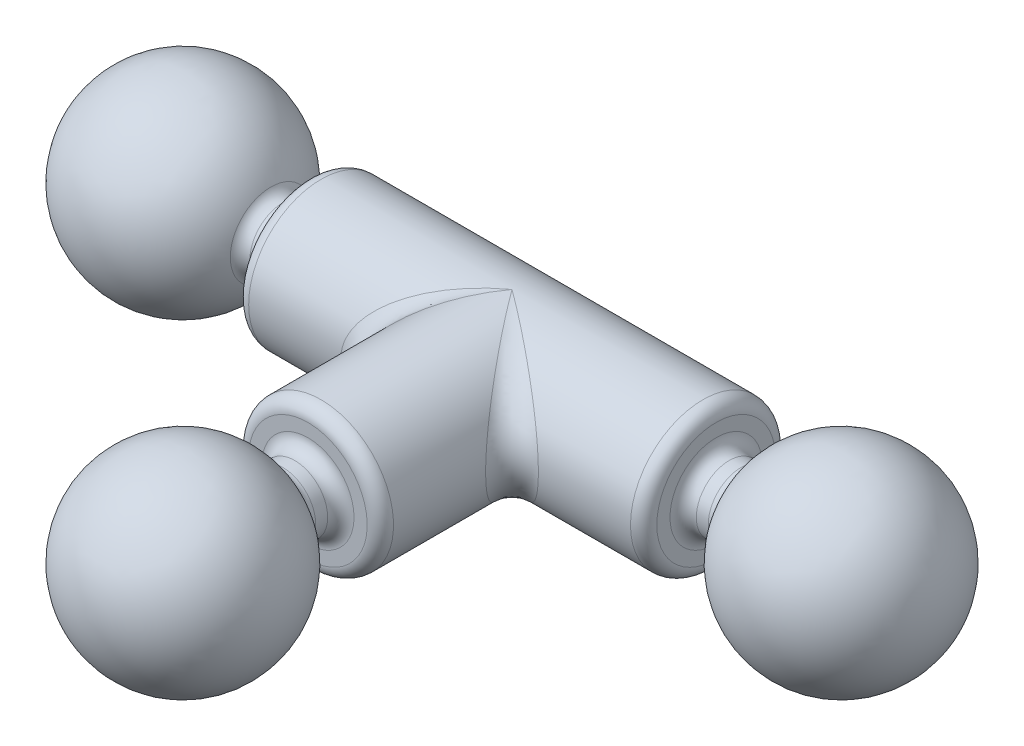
ISO-10303-21;
HEADER;
FILE_DESCRIPTION(('STEP AP214'),'2;1');
FILE_NAME('part.step','',(''),(''),'','','');
FILE_SCHEMA(('AUTOMOTIVE_DESIGN { 1 0 10303 214 1 1 1 1 }'));
ENDSEC;
DATA;
#1=APPLICATION_CONTEXT('core data for automotive mechanical design processes');
#2=APPLICATION_PROTOCOL_DEFINITION('international standard','automotive_design',2000,#1);
#3=PRODUCT_CONTEXT('',#1,'mechanical');
#4=PRODUCT('Part','Part','',(#3));
#5=PRODUCT_RELATED_PRODUCT_CATEGORY('part','',(#4));
#6=PRODUCT_DEFINITION_FORMATION('','',#4);
#7=PRODUCT_DEFINITION_CONTEXT('part definition',#1,'design');
#8=PRODUCT_DEFINITION('design','',#6,#7);
#9=PRODUCT_DEFINITION_SHAPE('','',#8);
#10=(LENGTH_UNIT() NAMED_UNIT(*) SI_UNIT(.MILLI.,.METRE.));
#11=(NAMED_UNIT(*) PLANE_ANGLE_UNIT() SI_UNIT($,.RADIAN.));
#12=(NAMED_UNIT(*) SI_UNIT($,.STERADIAN.) SOLID_ANGLE_UNIT());
#13=UNCERTAINTY_MEASURE_WITH_UNIT(LENGTH_MEASURE(1.E-05),#10,'distance_accuracy_value','');
#14=(GEOMETRIC_REPRESENTATION_CONTEXT(3) GLOBAL_UNCERTAINTY_ASSIGNED_CONTEXT((#13)) GLOBAL_UNIT_ASSIGNED_CONTEXT((#10,
#11,#12)) REPRESENTATION_CONTEXT('',''));
#15=CARTESIAN_POINT('',(0.,0.,0.));
#16=DIRECTION('',(0.,0.,1.));
#17=DIRECTION('',(1.,0.,0.));
#18=AXIS2_PLACEMENT_3D('',#15,#16,#17);
#19=CARTESIAN_POINT('',(-26.105626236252,0.,0.));
#20=DIRECTION('',(-1.,0.,0.));
#21=DIRECTION('',(0.,0.,1.));
#22=AXIS2_PLACEMENT_3D('',#19,#20,#21);
#23=CYLINDRICAL_SURFACE('',#22,6.985);
#24=CARTESIAN_POINT('',(50.165,0.,0.));
#25=DIRECTION('',(-1.,0.,0.));
#26=DIRECTION('',(0.,0.,1.));
#27=AXIS2_PLACEMENT_3D('',#24,#25,#26);
#28=CIRCLE('',#27,6.985);
#29=CARTESIAN_POINT('',(50.165,0.,6.985));
#30=VERTEX_POINT('',#29);
#31=EDGE_CURVE('E163',#30,#30,#28,.T.);
#32=ORIENTED_EDGE('',*,*,#31,.T.);
#33=EDGE_LOOP('',(#32));
#34=FACE_BOUND('',#33,.T.);
#35=CARTESIAN_POINT('',(13.335,0.,0.));
#36=DIRECTION('',(-1.,0.,0.));
#37=DIRECTION('',(0.,0.,1.));
#38=AXIS2_PLACEMENT_3D('',#35,#36,#37);
#39=CIRCLE('',#38,6.985);
#40=CARTESIAN_POINT('',(13.335,0.,6.985));
#41=VERTEX_POINT('',#40);
#42=EDGE_CURVE('E166',#41,#41,#39,.T.);
#43=ORIENTED_EDGE('',*,*,#42,.F.);
#44=EDGE_LOOP('',(#43));
#45=FACE_BOUND('',#44,.T.);
#46=CARTESIAN_POINT('',(31.75,0.,0.));
#47=DIRECTION('',(-0.591363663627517,0.,0.806404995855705));
#48=DIRECTION('',(-0.806404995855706,0.,-0.591363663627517));
#49=AXIS2_PLACEMENT_3D('',#46,#47,#48);
#50=ELLIPSE('',#49,11.8116827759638,6.985);
#51=CARTESIAN_POINT('',(31.75,6.985,0.));
#52=VERTEX_POINT('',#51);
#53=CARTESIAN_POINT('',(31.75,-6.985,0.));
#54=VERTEX_POINT('',#53);
#55=EDGE_CURVE('E45',#52,#54,#50,.F.);
#56=ORIENTED_EDGE('',*,*,#55,.T.);
#57=CARTESIAN_POINT('',(31.75,0.,0.));
#58=DIRECTION('',(0.591363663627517,0.,0.806404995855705));
#59=DIRECTION('',(0.806404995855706,0.,-0.591363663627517));
#60=AXIS2_PLACEMENT_3D('',#57,#58,#59);
#61=ELLIPSE('',#60,11.8116827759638,6.985);
#62=EDGE_CURVE('E11',#54,#52,#61,.F.);
#63=ORIENTED_EDGE('',*,*,#62,.T.);
#64=EDGE_LOOP('',(#56,#63));
#65=FACE_BOUND('',#64,.T.);
#66=ADVANCED_FACE('F32',(#34,#45,#65),#23,.T.);
#67=CARTESIAN_POINT('',(13.335,0.,0.));
#68=DIRECTION('',(-1.,0.,0.));
#69=DIRECTION('',(0.,0.,1.));
#70=AXIS2_PLACEMENT_3D('',#67,#68,#69);
#71=TOROIDAL_SURFACE('',#70,5.715,1.27);
#72=CARTESIAN_POINT('',(12.065,0.,0.));
#73=DIRECTION('',(-1.,0.,0.));
#74=DIRECTION('',(0.,0.,1.));
#75=AXIS2_PLACEMENT_3D('',#72,#73,#74);
#76=CIRCLE('',#75,5.715);
#77=CARTESIAN_POINT('',(12.065,0.,5.715));
#78=VERTEX_POINT('',#77);
#79=EDGE_CURVE('E63',#78,#78,#76,.T.);
#80=ORIENTED_EDGE('',*,*,#79,.F.);
#81=EDGE_LOOP('',(#80));
#82=FACE_BOUND('',#81,.T.);
#83=ORIENTED_EDGE('',*,*,#42,.T.);
#84=EDGE_LOOP('',(#83));
#85=FACE_BOUND('',#84,.T.);
#86=ADVANCED_FACE('F74',(#82,#85),#71,.T.);
#87=CARTESIAN_POINT('',(12.065,5.715,0.));
#88=DIRECTION('',(1.,0.,0.));
#89=DIRECTION('',(0.,0.,-1.));
#90=AXIS2_PLACEMENT_3D('',#87,#88,#89);
#91=PLANE('',#90);
#92=CARTESIAN_POINT('',(12.065,0.,0.));
#93=DIRECTION('',(-1.,0.,0.));
#94=DIRECTION('',(0.,0.,1.));
#95=AXIS2_PLACEMENT_3D('',#92,#93,#94);
#96=CIRCLE('',#95,4.445);
#97=CARTESIAN_POINT('',(12.065,0.,4.445));
#98=VERTEX_POINT('',#97);
#99=EDGE_CURVE('E134',#98,#98,#96,.T.);
#100=ORIENTED_EDGE('',*,*,#99,.F.);
#101=EDGE_LOOP('',(#100));
#102=FACE_BOUND('',#101,.T.);
#103=ORIENTED_EDGE('',*,*,#79,.T.);
#104=EDGE_LOOP('',(#103));
#105=FACE_BOUND('',#104,.T.);
#106=ADVANCED_FACE('F123',(#102,#105),#91,.F.);
#107=CARTESIAN_POINT('',(10.795,0.,0.));
#108=DIRECTION('',(-1.,0.,0.));
#109=DIRECTION('',(0.,0.,1.));
#110=AXIS2_PLACEMENT_3D('',#107,#108,#109);
#111=TOROIDAL_SURFACE('',#110,4.445,1.27);
#112=CARTESIAN_POINT('',(10.795,0.,0.));
#113=DIRECTION('',(-1.,0.,0.));
#114=DIRECTION('',(0.,0.,1.));
#115=AXIS2_PLACEMENT_3D('',#112,#113,#114);
#116=CIRCLE('',#115,3.175);
#117=CARTESIAN_POINT('',(10.795,0.,3.175));
#118=VERTEX_POINT('',#117);
#119=EDGE_CURVE('E137',#118,#118,#116,.T.);
#120=ORIENTED_EDGE('',*,*,#119,.F.);
#121=EDGE_LOOP('',(#120));
#122=FACE_BOUND('',#121,.T.);
#123=ORIENTED_EDGE('',*,*,#99,.T.);
#124=EDGE_LOOP('',(#123));
#125=FACE_BOUND('',#124,.T.);
#126=ADVANCED_FACE('F120',(#122,#125),#111,.F.);
#127=CARTESIAN_POINT('',(-26.105626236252,0.,0.));
#128=DIRECTION('',(-1.,0.,0.));
#129=DIRECTION('',(0.,0.,1.));
#130=AXIS2_PLACEMENT_3D('',#127,#128,#129);
#131=CYLINDRICAL_SURFACE('',#130,3.175);
#132=CARTESIAN_POINT('',(9.64193501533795,0.,0.));
#133=DIRECTION('',(-1.,0.,0.));
#134=DIRECTION('',(0.,0.,1.));
#135=AXIS2_PLACEMENT_3D('',#132,#133,#134);
#136=CIRCLE('',#135,3.175);
#137=CARTESIAN_POINT('',(9.64193501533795,0.,3.175));
#138=VERTEX_POINT('',#137);
#139=EDGE_CURVE('E142',#138,#138,#136,.T.);
#140=ORIENTED_EDGE('',*,*,#139,.F.);
#141=EDGE_LOOP('',(#140));
#142=FACE_BOUND('',#141,.T.);
#143=ORIENTED_EDGE('',*,*,#119,.T.);
#144=EDGE_LOOP('',(#143));
#145=FACE_BOUND('',#144,.T.);
#146=ADVANCED_FACE('F116',(#142,#145),#131,.T.);
#147=CARTESIAN_POINT('',(9.64193501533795,0.,0.));
#148=DIRECTION('',(-1.,0.,0.));
#149=DIRECTION('',(0.,0.,1.));
#150=AXIS2_PLACEMENT_3D('',#147,#148,#149);
#151=TOROIDAL_SURFACE('',#150,4.445,1.27);
#152=CARTESIAN_POINT('',(8.48859350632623,0.,0.));
#153=DIRECTION('',(-1.,0.,0.));
#154=DIRECTION('',(0.,0.,1.));
#155=AXIS2_PLACEMENT_3D('',#152,#153,#154);
#156=CIRCLE('',#155,3.9133014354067);
#157=CARTESIAN_POINT('',(8.48859350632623,0.,3.9133014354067));
#158=VERTEX_POINT('',#157);
#159=EDGE_CURVE('E145',#158,#158,#156,.T.);
#160=ORIENTED_EDGE('',*,*,#159,.F.);
#161=EDGE_LOOP('',(#160));
#162=FACE_BOUND('',#161,.T.);
#163=ORIENTED_EDGE('',*,*,#139,.T.);
#164=EDGE_LOOP('',(#163));
#165=FACE_BOUND('',#164,.T.);
#166=ADVANCED_FACE('F112',(#162,#165),#151,.F.);
#167=CARTESIAN_POINT('',(0.,0.,0.));
#168=DIRECTION('',(-1.,0.,0.));
#169=DIRECTION('',(0.,1.,0.));
#170=AXIS2_PLACEMENT_3D('',#167,#168,#169);
#171=SPHERICAL_SURFACE('',#170,9.3472);
#172=ORIENTED_EDGE('',*,*,#159,.T.);
#173=EDGE_LOOP('',(#172));
#174=FACE_BOUND('',#173,.T.);
#175=ADVANCED_FACE('F108',(#174),#171,.T.);
#176=CARTESIAN_POINT('',(63.5,0.,0.));
#177=DIRECTION('',(-1.,0.,0.));
#178=DIRECTION('',(0.,1.,0.));
#179=AXIS2_PLACEMENT_3D('',#176,#177,#178);
#180=SPHERICAL_SURFACE('',#179,9.3472);
#181=CARTESIAN_POINT('',(55.0114064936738,0.,0.));
#182=DIRECTION('',(-1.,0.,0.));
#183=DIRECTION('',(0.,0.,1.));
#184=AXIS2_PLACEMENT_3D('',#181,#182,#183);
#185=CIRCLE('',#184,3.9133014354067);
#186=CARTESIAN_POINT('',(55.0114064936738,0.,3.9133014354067));
#187=VERTEX_POINT('',#186);
#188=EDGE_CURVE('E148',#187,#187,#185,.T.);
#189=ORIENTED_EDGE('',*,*,#188,.F.);
#190=EDGE_LOOP('',(#189));
#191=FACE_BOUND('',#190,.T.);
#192=ADVANCED_FACE('F104',(#191),#180,.T.);
#193=CARTESIAN_POINT('',(53.8580649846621,0.,0.));
#194=DIRECTION('',(-1.,0.,0.));
#195=DIRECTION('',(0.,0.,1.));
#196=AXIS2_PLACEMENT_3D('',#193,#194,#195);
#197=TOROIDAL_SURFACE('',#196,4.445,1.27);
#198=CARTESIAN_POINT('',(53.8580649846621,0.,0.));
#199=DIRECTION('',(-1.,0.,0.));
#200=DIRECTION('',(0.,0.,1.));
#201=AXIS2_PLACEMENT_3D('',#198,#199,#200);
#202=CIRCLE('',#201,3.175);
#203=CARTESIAN_POINT('',(53.8580649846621,0.,3.175));
#204=VERTEX_POINT('',#203);
#205=EDGE_CURVE('E151',#204,#204,#202,.T.);
#206=ORIENTED_EDGE('',*,*,#205,.F.);
#207=EDGE_LOOP('',(#206));
#208=FACE_BOUND('',#207,.T.);
#209=ORIENTED_EDGE('',*,*,#188,.T.);
#210=EDGE_LOOP('',(#209));
#211=FACE_BOUND('',#210,.T.);
#212=ADVANCED_FACE('F100',(#208,#211),#197,.F.);
#213=CARTESIAN_POINT('',(-26.105626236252,0.,0.));
#214=DIRECTION('',(-1.,0.,0.));
#215=DIRECTION('',(0.,0.,1.));
#216=AXIS2_PLACEMENT_3D('',#213,#214,#215);
#217=CYLINDRICAL_SURFACE('',#216,3.175);
#218=CARTESIAN_POINT('',(52.705,0.,0.));
#219=DIRECTION('',(-1.,0.,0.));
#220=DIRECTION('',(0.,0.,1.));
#221=AXIS2_PLACEMENT_3D('',#218,#219,#220);
#222=CIRCLE('',#221,3.175);
#223=CARTESIAN_POINT('',(52.705,0.,3.175));
#224=VERTEX_POINT('',#223);
#225=EDGE_CURVE('E154',#224,#224,#222,.T.);
#226=ORIENTED_EDGE('',*,*,#225,.F.);
#227=EDGE_LOOP('',(#226));
#228=FACE_BOUND('',#227,.T.);
#229=ORIENTED_EDGE('',*,*,#205,.T.);
#230=EDGE_LOOP('',(#229));
#231=FACE_BOUND('',#230,.T.);
#232=ADVANCED_FACE('F96',(#228,#231),#217,.T.);
#233=CARTESIAN_POINT('',(52.705,0.,0.));
#234=DIRECTION('',(-1.,0.,0.));
#235=DIRECTION('',(0.,0.,1.));
#236=AXIS2_PLACEMENT_3D('',#233,#234,#235);
#237=TOROIDAL_SURFACE('',#236,4.445,1.27);
#238=CARTESIAN_POINT('',(51.435,0.,0.));
#239=DIRECTION('',(-1.,0.,0.));
#240=DIRECTION('',(0.,0.,1.));
#241=AXIS2_PLACEMENT_3D('',#238,#239,#240);
#242=CIRCLE('',#241,4.445);
#243=CARTESIAN_POINT('',(51.435,0.,4.445));
#244=VERTEX_POINT('',#243);
#245=EDGE_CURVE('E157',#244,#244,#242,.T.);
#246=ORIENTED_EDGE('',*,*,#245,.F.);
#247=EDGE_LOOP('',(#246));
#248=FACE_BOUND('',#247,.T.);
#249=ORIENTED_EDGE('',*,*,#225,.T.);
#250=EDGE_LOOP('',(#249));
#251=FACE_BOUND('',#250,.T.);
#252=ADVANCED_FACE('F92',(#248,#251),#237,.F.);
#253=CARTESIAN_POINT('',(51.435,5.715,0.));
#254=DIRECTION('',(-1.,0.,0.));
#255=DIRECTION('',(0.,0.,1.));
#256=AXIS2_PLACEMENT_3D('',#253,#254,#255);
#257=PLANE('',#256);
#258=CARTESIAN_POINT('',(51.435,0.,0.));
#259=DIRECTION('',(-1.,0.,0.));
#260=DIRECTION('',(0.,0.,1.));
#261=AXIS2_PLACEMENT_3D('',#258,#259,#260);
#262=CIRCLE('',#261,5.715);
#263=CARTESIAN_POINT('',(51.435,0.,5.715));
#264=VERTEX_POINT('',#263);
#265=EDGE_CURVE('E160',#264,#264,#262,.T.);
#266=ORIENTED_EDGE('',*,*,#265,.F.);
#267=EDGE_LOOP('',(#266));
#268=FACE_BOUND('',#267,.T.);
#269=ORIENTED_EDGE('',*,*,#245,.T.);
#270=EDGE_LOOP('',(#269));
#271=FACE_BOUND('',#270,.T.);
#272=ADVANCED_FACE('F88',(#268,#271),#257,.F.);
#273=CARTESIAN_POINT('',(50.165,0.,0.));
#274=DIRECTION('',(-1.,0.,0.));
#275=DIRECTION('',(0.,0.,1.));
#276=AXIS2_PLACEMENT_3D('',#273,#274,#275);
#277=TOROIDAL_SURFACE('',#276,5.715,1.27);
#278=ORIENTED_EDGE('',*,*,#31,.F.);
#279=EDGE_LOOP('',(#278));
#280=FACE_BOUND('',#279,.T.);
#281=ORIENTED_EDGE('',*,*,#265,.T.);
#282=EDGE_LOOP('',(#281));
#283=FACE_BOUND('',#282,.T.);
#284=ADVANCED_FACE('F84',(#280,#283),#277,.T.);
#285=CARTESIAN_POINT('',(31.75,0.,-13.9625883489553));
#286=DIRECTION('',(0.,0.,-1.));
#287=DIRECTION('',(-1.,0.,0.));
#288=AXIS2_PLACEMENT_3D('',#285,#286,#287);
#289=CYLINDRICAL_SURFACE('',#288,6.985);
#290=CARTESIAN_POINT('',(31.75,0.,18.415));
#291=DIRECTION('',(0.,0.,-1.));
#292=DIRECTION('',(-1.,0.,0.));
#293=AXIS2_PLACEMENT_3D('',#290,#291,#292);
#294=CIRCLE('',#293,6.985);
#295=CARTESIAN_POINT('',(24.765,0.,18.415));
#296=VERTEX_POINT('',#295);
#297=EDGE_CURVE('E169',#296,#296,#294,.T.);
#298=ORIENTED_EDGE('',*,*,#297,.T.);
#299=EDGE_LOOP('',(#298));
#300=FACE_BOUND('',#299,.T.);
#301=CARTESIAN_POINT('',(31.75,0.,0.));
#302=DIRECTION('',(-0.806404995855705,0.,0.591363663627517));
#303=DIRECTION('',(-0.591363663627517,0.,-0.806404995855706));
#304=AXIS2_PLACEMENT_3D('',#301,#302,#303);
#305=ELLIPSE('',#304,11.8116827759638,6.985);
#306=EDGE_CURVE('E56',#54,#52,#305,.T.);
#307=ORIENTED_EDGE('',*,*,#306,.T.);
#308=CARTESIAN_POINT('',(31.75,0.,0.));
#309=DIRECTION('',(0.806404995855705,0.,0.591363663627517));
#310=DIRECTION('',(0.591363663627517,0.,-0.806404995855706));
#311=AXIS2_PLACEMENT_3D('',#308,#309,#310);
#312=ELLIPSE('',#311,11.8116827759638,6.985);
#313=EDGE_CURVE('E59',#52,#54,#312,.T.);
#314=ORIENTED_EDGE('',*,*,#313,.T.);
#315=EDGE_LOOP('',(#307,#314));
#316=FACE_BOUND('',#315,.T.);
#317=ADVANCED_FACE('F62',(#300,#316),#289,.T.);
#318=CARTESIAN_POINT('',(31.75,0.,18.415));
#319=DIRECTION('',(0.,0.,-1.));
#320=DIRECTION('',(-1.,0.,0.));
#321=AXIS2_PLACEMENT_3D('',#318,#319,#320);
#322=TOROIDAL_SURFACE('',#321,5.715,1.27);
#323=ORIENTED_EDGE('',*,*,#297,.F.);
#324=EDGE_LOOP('',(#323));
#325=FACE_BOUND('',#324,.T.);
#326=CARTESIAN_POINT('',(31.75,0.,19.685));
#327=DIRECTION('',(0.,0.,-1.));
#328=DIRECTION('',(-1.,0.,0.));
#329=AXIS2_PLACEMENT_3D('',#326,#327,#328);
#330=CIRCLE('',#329,5.715);
#331=CARTESIAN_POINT('',(26.035,0.,19.685));
#332=VERTEX_POINT('',#331);
#333=EDGE_CURVE('E184',#332,#332,#330,.T.);
#334=ORIENTED_EDGE('',*,*,#333,.T.);
#335=EDGE_LOOP('',(#334));
#336=FACE_BOUND('',#335,.T.);
#337=ADVANCED_FACE('F83',(#325,#336),#322,.T.);
#338=CARTESIAN_POINT('',(31.75,0.,31.75));
#339=DIRECTION('',(0.,0.,-1.));
#340=DIRECTION('',(0.,1.,0.));
#341=AXIS2_PLACEMENT_3D('',#338,#339,#340);
#342=SPHERICAL_SURFACE('',#341,9.3472);
#343=CARTESIAN_POINT('',(31.75,0.,23.2614064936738));
#344=DIRECTION('',(0.,0.,-1.));
#345=DIRECTION('',(-1.,0.,0.));
#346=AXIS2_PLACEMENT_3D('',#343,#344,#345);
#347=CIRCLE('',#346,3.9133014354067);
#348=CARTESIAN_POINT('',(27.8366985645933,0.,23.2614064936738));
#349=VERTEX_POINT('',#348);
#350=EDGE_CURVE('E172',#349,#349,#347,.T.);
#351=ORIENTED_EDGE('',*,*,#350,.F.);
#352=EDGE_LOOP('',(#351));
#353=FACE_BOUND('',#352,.T.);
#354=ADVANCED_FACE('F209',(#353),#342,.T.);
#355=CARTESIAN_POINT('',(31.75,0.,22.1080649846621));
#356=DIRECTION('',(0.,0.,-1.));
#357=DIRECTION('',(-1.,0.,0.));
#358=AXIS2_PLACEMENT_3D('',#355,#356,#357);
#359=TOROIDAL_SURFACE('',#358,4.445,1.27);
#360=CARTESIAN_POINT('',(31.75,0.,22.1080649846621));
#361=DIRECTION('',(0.,0.,-1.));
#362=DIRECTION('',(-1.,0.,0.));
#363=AXIS2_PLACEMENT_3D('',#360,#361,#362);
#364=CIRCLE('',#363,3.175);
#365=CARTESIAN_POINT('',(28.575,0.,22.1080649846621));
#366=VERTEX_POINT('',#365);
#367=EDGE_CURVE('E175',#366,#366,#364,.T.);
#368=ORIENTED_EDGE('',*,*,#367,.F.);
#369=EDGE_LOOP('',(#368));
#370=FACE_BOUND('',#369,.T.);
#371=ORIENTED_EDGE('',*,*,#350,.T.);
#372=EDGE_LOOP('',(#371));
#373=FACE_BOUND('',#372,.T.);
#374=ADVANCED_FACE('F203',(#370,#373),#359,.F.);
#375=CARTESIAN_POINT('',(31.75,0.,-13.9625883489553));
#376=DIRECTION('',(0.,0.,-1.));
#377=DIRECTION('',(-1.,0.,0.));
#378=AXIS2_PLACEMENT_3D('',#375,#376,#377);
#379=CYLINDRICAL_SURFACE('',#378,3.175);
#380=CARTESIAN_POINT('',(31.75,0.,20.955));
#381=DIRECTION('',(0.,0.,-1.));
#382=DIRECTION('',(-1.,0.,0.));
#383=AXIS2_PLACEMENT_3D('',#380,#381,#382);
#384=CIRCLE('',#383,3.175);
#385=CARTESIAN_POINT('',(28.575,0.,20.955));
#386=VERTEX_POINT('',#385);
#387=EDGE_CURVE('E178',#386,#386,#384,.T.);
#388=ORIENTED_EDGE('',*,*,#387,.F.);
#389=EDGE_LOOP('',(#388));
#390=FACE_BOUND('',#389,.T.);
#391=ORIENTED_EDGE('',*,*,#367,.T.);
#392=EDGE_LOOP('',(#391));
#393=FACE_BOUND('',#392,.T.);
#394=ADVANCED_FACE('F197',(#390,#393),#379,.T.);
#395=CARTESIAN_POINT('',(31.75,0.,20.955));
#396=DIRECTION('',(0.,0.,-1.));
#397=DIRECTION('',(-1.,0.,0.));
#398=AXIS2_PLACEMENT_3D('',#395,#396,#397);
#399=TOROIDAL_SURFACE('',#398,4.445,1.27);
#400=CARTESIAN_POINT('',(31.75,0.,19.685));
#401=DIRECTION('',(0.,0.,-1.));
#402=DIRECTION('',(-1.,0.,0.));
#403=AXIS2_PLACEMENT_3D('',#400,#401,#402);
#404=CIRCLE('',#403,4.445);
#405=CARTESIAN_POINT('',(27.305,0.,19.685));
#406=VERTEX_POINT('',#405);
#407=EDGE_CURVE('E181',#406,#406,#404,.T.);
#408=ORIENTED_EDGE('',*,*,#407,.F.);
#409=EDGE_LOOP('',(#408));
#410=FACE_BOUND('',#409,.T.);
#411=ORIENTED_EDGE('',*,*,#387,.T.);
#412=EDGE_LOOP('',(#411));
#413=FACE_BOUND('',#412,.T.);
#414=ADVANCED_FACE('F191',(#410,#413),#399,.F.);
#415=CARTESIAN_POINT('',(31.75,5.715,19.685));
#416=DIRECTION('',(0.,0.,-1.));
#417=DIRECTION('',(-1.,0.,0.));
#418=AXIS2_PLACEMENT_3D('',#415,#416,#417);
#419=PLANE('',#418);
#420=ORIENTED_EDGE('',*,*,#333,.F.);
#421=EDGE_LOOP('',(#420));
#422=FACE_BOUND('',#421,.T.);
#423=ORIENTED_EDGE('',*,*,#407,.T.);
#424=EDGE_LOOP('',(#423));
#425=FACE_BOUND('',#424,.T.);
#426=ADVANCED_FACE('F73',(#422,#425),#419,.F.);
#427=CARTESIAN_POINT('',(31.75,-6.985,0.));
#428=CARTESIAN_POINT('',(31.75,-6.985,0.));
#429=CARTESIAN_POINT('',(31.75,-6.985,0.));
#430=CARTESIAN_POINT('',(31.5424813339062,-6.984991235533,0.152180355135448));
#431=CARTESIAN_POINT('',(31.5701506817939,-6.9850170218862,0.179849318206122));
#432=CARTESIAN_POINT('',(31.5978196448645,-6.984991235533,0.207518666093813));
#433=CARTESIAN_POINT('',(31.3349925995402,-6.98002686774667,0.304338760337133));
#434=CARTESIAN_POINT('',(31.3901995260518,-6.9782121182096,0.359800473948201));
#435=CARTESIAN_POINT('',(31.4456612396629,-6.98002686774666,0.415007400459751));
#436=CARTESIAN_POINT('',(30.920443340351,-6.96012788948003,0.608341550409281));
#437=CARTESIAN_POINT('',(31.031277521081,-6.95108211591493,0.718722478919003));
#438=CARTESIAN_POINT('',(31.1416584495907,-6.96012788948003,0.829556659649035));
#439=CARTESIAN_POINT('',(30.7133828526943,-6.94519244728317,0.760185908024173));
#440=CARTESIAN_POINT('',(30.8520522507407,-6.93071724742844,0.897947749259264));
#441=CARTESIAN_POINT('',(30.9898140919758,-6.94519244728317,1.0366171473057));
#442=CARTESIAN_POINT('',(30.0970885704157,-6.88569361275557,1.21213504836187));
#443=CARTESIAN_POINT('',(30.3193165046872,-6.84963168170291,1.4306834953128));
#444=CARTESIAN_POINT('',(30.5378649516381,-6.88569361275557,1.65291142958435));
#445=CARTESIAN_POINT('',(29.6890725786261,-6.82643806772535,1.51134677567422));
#446=CARTESIAN_POINT('',(29.9675689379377,-6.76865979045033,1.78243106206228));
#447=CARTESIAN_POINT('',(30.2386532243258,-6.82643806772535,2.06092742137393));
#448=CARTESIAN_POINT('',(28.8872063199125,-6.66887827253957,2.09938203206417));
#449=CARTESIAN_POINT('',(29.2840392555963,-6.55587890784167,2.46596074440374));
#450=CARTESIAN_POINT('',(29.6506179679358,-6.66887827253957,2.8627936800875));
#451=CARTESIAN_POINT('',(28.493233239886,-6.57124565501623,2.3882956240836));
#452=CARTESIAN_POINT('',(28.9502430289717,-6.42376355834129,2.79975697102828));
#453=CARTESIAN_POINT('',(29.3617043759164,-6.57124565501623,3.25676676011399));
#454=CARTESIAN_POINT('',(27.7262127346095,-6.33825696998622,2.950777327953));
#455=CARTESIAN_POINT('',(28.3111092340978,-6.11331309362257,3.43889076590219));
#456=CARTESIAN_POINT('',(28.799222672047,-6.33825696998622,4.02378726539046));
#457=CARTESIAN_POINT('',(27.3528889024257,-6.20388944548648,3.22454813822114));
#458=CARTESIAN_POINT('',(28.0038231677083,-5.93452750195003,3.74617683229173));
#459=CARTESIAN_POINT('',(28.5254518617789,-6.20388944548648,4.39711109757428));
#460=CARTESIAN_POINT('',(26.6337414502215,-5.89940962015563,3.75192293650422));
#461=CARTESIAN_POINT('',(27.4257208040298,-5.53749996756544,4.3242791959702));
#462=CARTESIAN_POINT('',(27.9980770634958,-5.89940962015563,5.11625854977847));
#463=CARTESIAN_POINT('',(26.2874207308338,-5.7305712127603,4.00589146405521));
#464=CARTESIAN_POINT('',(27.1530753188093,-5.31869043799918,4.59692468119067));
#465=CARTESIAN_POINT('',(27.7441085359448,-5.7305712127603,5.46257926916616));
#466=CARTESIAN_POINT('',(25.6284350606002,-5.35975565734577,4.48914762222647));
#467=CARTESIAN_POINT('',(26.6511858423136,-4.85084033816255,5.09881415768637));
#468=CARTESIAN_POINT('',(27.2608523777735,-5.35975565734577,6.12156493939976));
#469=CARTESIAN_POINT('',(25.3149913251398,-5.15928128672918,4.71900636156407));
#470=CARTESIAN_POINT('',(26.4203074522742,-4.60117676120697,5.3296925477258));
#471=CARTESIAN_POINT('',(27.0309936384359,-5.15928128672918,6.43500867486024));
#472=CARTESIAN_POINT('',(24.7274129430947,-4.72837889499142,5.14989717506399));
#473=CARTESIAN_POINT('',(26.0070316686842,-4.08348087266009,5.74296833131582));
#474=CARTESIAN_POINT('',(26.600102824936,-4.72837889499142,7.02258705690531));
#475=CARTESIAN_POINT('',(24.4521725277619,-4.49959081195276,5.35174014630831));
#476=CARTESIAN_POINT('',(25.8232825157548,-3.81488376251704,5.92671748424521));
#477=CARTESIAN_POINT('',(26.3982598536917,-4.49959081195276,7.29782747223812));
#478=CARTESIAN_POINT('',(23.9460817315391,-4.01592615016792,5.72287339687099));
#479=CARTESIAN_POINT('',(25.5062622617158,-3.27348203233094,6.24373773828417));
#480=CARTESIAN_POINT('',(26.027126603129,-4.01592615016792,7.80391826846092));
#481=CARTESIAN_POINT('',(23.7137921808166,-3.7626844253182,5.89321906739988));
#482=CARTESIAN_POINT('',(25.3720030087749,-3.00034770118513,6.37799699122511));
#483=CARTESIAN_POINT('',(25.8567809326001,-3.7626844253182,8.03620781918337));
#484=CARTESIAN_POINT('',(23.2978168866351,-3.2342480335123,6.19826761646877));
#485=CARTESIAN_POINT('',(25.1513860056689,-2.46464840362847,6.59861399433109));
#486=CARTESIAN_POINT('',(25.5517323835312,-3.2342480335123,8.45218311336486));
#487=CARTESIAN_POINT('',(23.1124376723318,-2.96051683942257,6.33421237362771));
#488=CARTESIAN_POINT('',(25.0644369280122,-2.20220161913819,6.68556307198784));
#489=CARTESIAN_POINT('',(25.4157876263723,-2.96051683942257,8.63756232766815));
#490=CARTESIAN_POINT('',(22.8719616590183,-2.53481154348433,6.51056145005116));
#491=CARTESIAN_POINT('',(24.9638205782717,-1.82528725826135,6.78617942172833));
#492=CARTESIAN_POINT('',(25.2394385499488,-2.53481154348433,8.87803834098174));
#493=CARTESIAN_POINT('',(22.7991913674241,-2.39340192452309,6.56392633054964));
#494=CARTESIAN_POINT('',(24.9354391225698,-1.70372223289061,6.81456087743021));
#495=CARTESIAN_POINT('',(25.1860736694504,-2.39340192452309,8.95080863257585));
#496=CARTESIAN_POINT('',(22.6653444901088,-2.10477969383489,6.66208070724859));
#497=CARTESIAN_POINT('',(24.8864700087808,-1.46462364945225,6.8635299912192));
#498=CARTESIAN_POINT('',(25.0879192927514,-2.10477969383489,9.08465550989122));
#499=CARTESIAN_POINT('',(22.6042622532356,-1.9575699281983,6.7068743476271));
#500=CARTESIAN_POINT('',(24.8660132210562,-1.34733100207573,6.88398677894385));
#501=CARTESIAN_POINT('',(25.0431256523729,-1.9575699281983,9.14573774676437));
#502=CARTESIAN_POINT('',(22.4964615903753,-1.66254066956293,6.78592816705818));
#503=CARTESIAN_POINT('',(24.8322705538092,-1.12088517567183,6.91772944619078));
#504=CARTESIAN_POINT('',(24.9640718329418,-1.66254066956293,9.25353840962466));
#505=CARTESIAN_POINT('',(22.4493731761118,-1.51486676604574,6.82045967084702));
#506=CARTESIAN_POINT('',(24.8188845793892,-1.01183008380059,6.93111542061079));
#507=CARTESIAN_POINT('',(24.929540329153,-1.51486676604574,9.30062682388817));
#508=CARTESIAN_POINT('',(22.3680959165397,-1.21580690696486,6.88006299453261));
#509=CARTESIAN_POINT('',(24.7971610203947,-0.798095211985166,6.95283897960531));
#510=CARTESIAN_POINT('',(24.8699370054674,-1.21580690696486,9.38190408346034));
#511=CARTESIAN_POINT('',(22.3339008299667,-1.06442278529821,6.90513939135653));
#512=CARTESIAN_POINT('',(24.7888876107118,-0.693701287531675,6.96111238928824));
#513=CARTESIAN_POINT('',(24.8448606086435,-1.06442278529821,9.41609917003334));
#514=CARTESIAN_POINT('',(22.279515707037,-0.761485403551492,6.94502181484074));
#515=CARTESIAN_POINT('',(24.7763240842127,-0.48997733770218,6.97367591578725));
#516=CARTESIAN_POINT('',(24.8049781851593,-0.761485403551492,9.47048429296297));
#517=CARTESIAN_POINT('',(22.2591091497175,-0.609974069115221,6.95998662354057));
#518=CARTESIAN_POINT('',(24.7720089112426,-0.390868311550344,6.97799108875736));
#519=CARTESIAN_POINT('',(24.7900133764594,-0.609974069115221,9.49089085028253));
#520=CARTESIAN_POINT('',(22.2318514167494,-0.30564180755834,6.97997562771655));
#521=CARTESIAN_POINT('',(24.7663386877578,-0.194365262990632,6.98366131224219));
#522=CARTESIAN_POINT('',(24.7700243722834,-0.30564180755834,9.51814858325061));
#523=CARTESIAN_POINT('',(22.225,-0.15282090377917,6.985));
#524=CARTESIAN_POINT('',(24.765,-0.0972526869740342,6.985));
#525=CARTESIAN_POINT('',(24.765,-0.15282090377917,9.525));
#526=CARTESIAN_POINT('',(22.225,0.152820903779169,6.985));
#527=CARTESIAN_POINT('',(24.765,0.0972526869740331,6.985));
#528=CARTESIAN_POINT('',(24.765,0.152820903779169,9.525));
#529=CARTESIAN_POINT('',(22.2318514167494,0.305641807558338,6.97997562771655));
#530=CARTESIAN_POINT('',(24.7663386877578,0.194365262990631,6.98366131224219));
#531=CARTESIAN_POINT('',(24.7700243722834,0.305641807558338,9.51814858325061));
#532=CARTESIAN_POINT('',(22.2591091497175,0.60997406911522,6.95998662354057));
#533=CARTESIAN_POINT('',(24.7720089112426,0.390868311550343,6.97799108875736));
#534=CARTESIAN_POINT('',(24.7900133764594,0.60997406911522,9.49089085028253));
#535=CARTESIAN_POINT('',(22.279515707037,0.76148540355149,6.94502181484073));
#536=CARTESIAN_POINT('',(24.7763240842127,0.489977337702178,6.97367591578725));
#537=CARTESIAN_POINT('',(24.8049781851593,0.761485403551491,9.47048429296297));
#538=CARTESIAN_POINT('',(22.3339008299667,1.06442278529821,6.90513939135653));
#539=CARTESIAN_POINT('',(24.7888876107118,0.693701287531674,6.96111238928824));
#540=CARTESIAN_POINT('',(24.8448606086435,1.06442278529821,9.41609917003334));
#541=CARTESIAN_POINT('',(22.3680959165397,1.21580690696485,6.88006299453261));
#542=CARTESIAN_POINT('',(24.7971610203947,0.798095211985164,6.95283897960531));
#543=CARTESIAN_POINT('',(24.8699370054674,1.21580690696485,9.38190408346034));
#544=CARTESIAN_POINT('',(22.4493731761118,1.51486676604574,6.82045967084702));
#545=CARTESIAN_POINT('',(24.8188845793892,1.01183008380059,6.93111542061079));
#546=CARTESIAN_POINT('',(24.929540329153,1.51486676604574,9.30062682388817));
#547=CARTESIAN_POINT('',(22.4964615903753,1.66254066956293,6.78592816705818));
#548=CARTESIAN_POINT('',(24.8322705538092,1.12088517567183,6.91772944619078));
#549=CARTESIAN_POINT('',(24.9640718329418,1.66254066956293,9.25353840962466));
#550=CARTESIAN_POINT('',(22.6042622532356,1.9575699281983,6.7068743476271));
#551=CARTESIAN_POINT('',(24.8660132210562,1.34733100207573,6.88398677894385));
#552=CARTESIAN_POINT('',(25.0431256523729,1.9575699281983,9.14573774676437));
#553=CARTESIAN_POINT('',(22.6653444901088,2.10477969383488,6.66208070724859));
#554=CARTESIAN_POINT('',(24.8864700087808,1.46462364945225,6.8635299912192));
#555=CARTESIAN_POINT('',(25.0879192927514,2.10477969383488,9.08465550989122));
#556=CARTESIAN_POINT('',(22.7991913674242,2.39340192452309,6.56392633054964));
#557=CARTESIAN_POINT('',(24.9354391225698,1.7037222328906,6.81456087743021));
#558=CARTESIAN_POINT('',(25.1860736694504,2.39340192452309,8.95080863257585));
#559=CARTESIAN_POINT('',(22.8719616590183,2.53481154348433,6.51056145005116));
#560=CARTESIAN_POINT('',(24.9638205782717,1.82528725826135,6.78617942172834));
#561=CARTESIAN_POINT('',(25.2394385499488,2.53481154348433,8.87803834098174));
#562=CARTESIAN_POINT('',(23.1124376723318,2.96051683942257,6.33421237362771));
#563=CARTESIAN_POINT('',(25.0644369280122,2.20220161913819,6.68556307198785));
#564=CARTESIAN_POINT('',(25.4157876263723,2.96051683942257,8.63756232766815));
#565=CARTESIAN_POINT('',(23.2978168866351,3.2342480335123,6.19826761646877));
#566=CARTESIAN_POINT('',(25.1513860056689,2.46464840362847,6.59861399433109));
#567=CARTESIAN_POINT('',(25.5517323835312,3.2342480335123,8.45218311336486));
#568=CARTESIAN_POINT('',(23.7137921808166,3.7626844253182,5.89321906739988));
#569=CARTESIAN_POINT('',(25.3720030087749,3.00034770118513,6.3779969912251));
#570=CARTESIAN_POINT('',(25.8567809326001,3.7626844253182,8.03620781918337));
#571=CARTESIAN_POINT('',(23.9460817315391,4.01592615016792,5.72287339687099));
#572=CARTESIAN_POINT('',(25.5062622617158,3.27348203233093,6.24373773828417));
#573=CARTESIAN_POINT('',(26.027126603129,4.01592615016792,7.80391826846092));
#574=CARTESIAN_POINT('',(24.4521725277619,4.49959081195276,5.35174014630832));
#575=CARTESIAN_POINT('',(25.8232825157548,3.81488376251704,5.92671748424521));
#576=CARTESIAN_POINT('',(26.3982598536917,4.49959081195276,7.29782747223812));
#577=CARTESIAN_POINT('',(24.7274129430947,4.72837889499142,5.14989717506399));
#578=CARTESIAN_POINT('',(26.0070316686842,4.08348087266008,5.74296833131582));
#579=CARTESIAN_POINT('',(26.600102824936,4.72837889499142,7.02258705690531));
#580=CARTESIAN_POINT('',(25.3149913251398,5.15928128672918,4.71900636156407));
#581=CARTESIAN_POINT('',(26.4203074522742,4.60117676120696,5.32969254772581));
#582=CARTESIAN_POINT('',(27.0309936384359,5.15928128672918,6.43500867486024));
#583=CARTESIAN_POINT('',(25.6284350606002,5.35975565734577,4.48914762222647));
#584=CARTESIAN_POINT('',(26.6511858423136,4.85084033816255,5.09881415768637));
#585=CARTESIAN_POINT('',(27.2608523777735,5.35975565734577,6.12156493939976));
#586=CARTESIAN_POINT('',(26.2874207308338,5.7305712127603,4.00589146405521));
#587=CARTESIAN_POINT('',(27.1530753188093,5.31869043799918,4.59692468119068));
#588=CARTESIAN_POINT('',(27.7441085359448,5.7305712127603,5.46257926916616));
#589=CARTESIAN_POINT('',(26.6337414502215,5.89940962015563,3.75192293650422));
#590=CARTESIAN_POINT('',(27.4257208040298,5.53749996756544,4.3242791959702));
#591=CARTESIAN_POINT('',(27.9980770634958,5.89940962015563,5.11625854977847));
#592=CARTESIAN_POINT('',(27.3528889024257,6.20388944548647,3.22454813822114));
#593=CARTESIAN_POINT('',(28.0038231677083,5.93452750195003,3.74617683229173));
#594=CARTESIAN_POINT('',(28.5254518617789,6.20388944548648,4.39711109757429));
#595=CARTESIAN_POINT('',(27.7262127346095,6.33825696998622,2.950777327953));
#596=CARTESIAN_POINT('',(28.3111092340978,6.11331309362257,3.4388907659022));
#597=CARTESIAN_POINT('',(28.799222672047,6.33825696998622,4.02378726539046));
#598=CARTESIAN_POINT('',(28.493233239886,6.57124565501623,2.3882956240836));
#599=CARTESIAN_POINT('',(28.9502430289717,6.42376355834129,2.79975697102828));
#600=CARTESIAN_POINT('',(29.3617043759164,6.57124565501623,3.25676676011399));
#601=CARTESIAN_POINT('',(28.8872063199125,6.66887827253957,2.09938203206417));
#602=CARTESIAN_POINT('',(29.2840392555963,6.55587890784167,2.46596074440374));
#603=CARTESIAN_POINT('',(29.6506179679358,6.66887827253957,2.8627936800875));
#604=CARTESIAN_POINT('',(29.6890725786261,6.82643806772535,1.51134677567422));
#605=CARTESIAN_POINT('',(29.9675689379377,6.76865979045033,1.78243106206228));
#606=CARTESIAN_POINT('',(30.2386532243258,6.82643806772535,2.06092742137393));
#607=CARTESIAN_POINT('',(30.0970885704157,6.88569361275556,1.21213504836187));
#608=CARTESIAN_POINT('',(30.3193165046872,6.84963168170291,1.4306834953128));
#609=CARTESIAN_POINT('',(30.5378649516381,6.88569361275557,1.65291142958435));
#610=CARTESIAN_POINT('',(30.7133828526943,6.94519244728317,0.760185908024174));
#611=CARTESIAN_POINT('',(30.8520522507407,6.93071724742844,0.897947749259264));
#612=CARTESIAN_POINT('',(30.9898140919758,6.94519244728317,1.0366171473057));
#613=CARTESIAN_POINT('',(30.920443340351,6.96012788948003,0.608341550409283));
#614=CARTESIAN_POINT('',(31.031277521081,6.95108211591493,0.718722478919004));
#615=CARTESIAN_POINT('',(31.1416584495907,6.96012788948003,0.829556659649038));
#616=CARTESIAN_POINT('',(31.3349925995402,6.98002686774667,0.304338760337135));
#617=CARTESIAN_POINT('',(31.3901995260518,6.9782121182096,0.359800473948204));
#618=CARTESIAN_POINT('',(31.4456612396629,6.98002686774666,0.415007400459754));
#619=CARTESIAN_POINT('',(31.5424813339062,6.984991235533,0.15218035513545));
#620=CARTESIAN_POINT('',(31.5701506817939,6.9850170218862,0.179849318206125));
#621=CARTESIAN_POINT('',(31.5978196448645,6.984991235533,0.207518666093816));
#622=CARTESIAN_POINT('',(31.75,6.985,0.));
#623=CARTESIAN_POINT('',(31.75,6.985,0.));
#624=CARTESIAN_POINT('',(31.75,6.985,0.));
#625=(BOUNDED_SURFACE() B_SPLINE_SURFACE(3,2,((#427,#428,#429),(#430,#431,#432),(#433,#434,
#435),(#436,#437,#438),(#439,#440,#441),(#442,#443,#444),(#445,#446,#447),(#448,#449,#450),
(#451,#452,#453),(#454,#455,#456),(#457,#458,#459),(#460,#461,#462),(#463,#464,#465),(#466,#467,
#468),(#469,#470,#471),(#472,#473,#474),(#475,#476,#477),(#478,#479,#480),(#481,#482,#483),
(#484,#485,#486),(#487,#488,#489),(#490,#491,#492),(#493,#494,#495),(#496,#497,#498),(#499,#500,
#501),(#502,#503,#504),(#505,#506,#507),(#508,#509,#510),(#511,#512,#513),(#514,#515,#516),
(#517,#518,#519),(#520,#521,#522),(#523,#524,#525),(#526,#527,#528),(#529,#530,#531),(#532,#533,
#534),(#535,#536,#537),(#538,#539,#540),(#541,#542,#543),(#544,#545,#546),(#547,#548,#549),
(#550,#551,#552),(#553,#554,#555),(#556,#557,#558),(#559,#560,#561),(#562,#563,#564),(#565,#566,
#567),(#568,#569,#570),(#571,#572,#573),(#574,#575,#576),(#577,#578,#579),(#580,#581,#582),
(#583,#584,#585),(#586,#587,#588),(#589,#590,#591),(#592,#593,#594),(#595,#596,#597),(#598,#599,
#600),(#601,#602,#603),(#604,#605,#606),(#607,#608,#609),(#610,#611,#612),(#613,#614,#615),
(#616,#617,#618),(#619,#620,#621),(#622,#623,#624)),.UNSPECIFIED.,.F.,.F.,
.F.) B_SPLINE_SURFACE_WITH_KNOTS((4,2,2,2,2,2,2,2,2,2,2,2,2,2,2,2,2,2,2,2,2,2,2,2,2,2,2,2,2,2,2,
2,4),(3,3),(0.,0.880262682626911,1.7605987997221,3.50576319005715,5.22165601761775,
6.89527886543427,8.51563018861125,10.0744186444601,11.5667994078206,12.9921005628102,
14.3544545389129,15.0095462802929,15.6643204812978,16.2998145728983,16.9350006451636,
17.5599649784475,18.1849181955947,18.8098714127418,19.4348357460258,20.0700218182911,
20.7055159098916,21.3602901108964,22.0153818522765,23.3777358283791,24.8030369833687,
26.2954177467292,27.8542062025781,29.4745575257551,31.1481803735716,32.8640732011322,
34.6092375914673,35.4895737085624,36.3698363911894),(0.,1.),
.UNSPECIFIED.) GEOMETRIC_REPRESENTATION_ITEM() RATIONAL_B_SPLINE_SURFACE(((1.,1.,1.),(1.,
0.999999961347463,1.),(1.,0.999643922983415,1.),(1.,0.998220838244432,1.),(1.,0.9971537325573,
1.),(1.,0.992912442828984,1.),(1.,0.988698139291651,1.),(1.,0.97761667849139,1.),(1.,
0.970795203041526,1.),(1.,0.954789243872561,1.),(1.,0.945667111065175,1.),(1.,0.925487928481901,
1.),(1.,0.914501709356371,1.),(1.,0.891170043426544,1.),(1.,0.878892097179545,1.),(1.,
0.853706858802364,1.),(1.,0.840848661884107,1.),(1.,0.815387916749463,1.),(1.,0.802799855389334,
1.),(1.,0.778879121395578,1.),(1.,0.767515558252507,1.),(1.,0.752114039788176,1.),(1.,
0.747335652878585,1.),(1.,0.738380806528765,1.),(1.,0.734204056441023,1.),(1.,0.726720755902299,
1.),(1.,0.723392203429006,1.),(1.,0.717584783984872,1.),(1.,0.715105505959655,1.),(1.,
0.711136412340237,1.),(1.,0.709631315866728,1.),(1.,0.70761650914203,1.),(1.,0.707106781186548,
1.),(1.,0.707106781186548,1.),(1.,0.70761650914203,1.),(1.,0.709631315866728,1.),(1.,
0.711136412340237,1.),(1.,0.715105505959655,1.),(1.,0.717584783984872,1.),(1.,0.723392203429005,
1.),(1.,0.726720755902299,1.),(1.,0.734204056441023,1.),(1.,0.738380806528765,1.),(1.,
0.747335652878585,1.),(1.,0.752114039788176,1.),(1.,0.767515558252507,1.),(1.,0.778879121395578,
1.),(1.,0.802799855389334,1.),(1.,0.815387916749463,1.),(1.,0.840848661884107,1.),(1.,
0.853706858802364,1.),(1.,0.878892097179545,1.),(1.,0.891170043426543,1.),(1.,0.914501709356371,
1.),(1.,0.925487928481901,1.),(1.,0.945667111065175,1.),(1.,0.954789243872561,1.),(1.,
0.970795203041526,1.),(1.,0.97761667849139,1.),(1.,0.988698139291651,1.),(1.,0.992912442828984,
1.),(1.,0.9971537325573,1.),(1.,0.998220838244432,1.),(1.,0.999643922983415,1.),(1.,
0.999999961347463,1.),(1.,1.,1.))) REPRESENTATION_ITEM('') SURFACE());
#626=ORIENTED_EDGE('',*,*,#313,.F.);
#627=ORIENTED_EDGE('',*,*,#62,.F.);
#628=EDGE_LOOP('',(#626,#627));
#629=FACE_BOUND('',#628,.T.);
#630=ADVANCED_FACE('F65',(#629),#625,.F.);
#631=CARTESIAN_POINT('',(31.75,6.985,0.));
#632=CARTESIAN_POINT('',(31.75,6.985,0.));
#633=CARTESIAN_POINT('',(31.75,6.985,0.));
#634=CARTESIAN_POINT('',(31.9575186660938,6.984991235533,0.152180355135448));
#635=CARTESIAN_POINT('',(31.9298493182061,6.9850170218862,0.179849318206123));
#636=CARTESIAN_POINT('',(31.9021803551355,6.984991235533,0.207518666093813));
#637=CARTESIAN_POINT('',(32.1650074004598,6.98002686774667,0.304338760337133));
#638=CARTESIAN_POINT('',(32.1098004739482,6.9782121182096,0.359800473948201));
#639=CARTESIAN_POINT('',(32.0543387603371,6.98002686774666,0.415007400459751));
#640=CARTESIAN_POINT('',(32.5795566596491,6.96012788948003,0.608341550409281));
#641=CARTESIAN_POINT('',(32.468722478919,6.95108211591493,0.718722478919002));
#642=CARTESIAN_POINT('',(32.3583415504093,6.96012788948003,0.829556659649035));
#643=CARTESIAN_POINT('',(32.7866171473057,6.94519244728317,0.760185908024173));
#644=CARTESIAN_POINT('',(32.6479477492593,6.93071724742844,0.897947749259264));
#645=CARTESIAN_POINT('',(32.5101859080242,6.94519244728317,1.0366171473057));
#646=CARTESIAN_POINT('',(33.4029114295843,6.88569361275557,1.21213504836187));
#647=CARTESIAN_POINT('',(33.1806834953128,6.84963168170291,1.4306834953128));
#648=CARTESIAN_POINT('',(32.9621350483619,6.88569361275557,1.65291142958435));
#649=CARTESIAN_POINT('',(33.8109274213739,6.82643806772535,1.51134677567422));
#650=CARTESIAN_POINT('',(33.5324310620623,6.76865979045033,1.78243106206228));
#651=CARTESIAN_POINT('',(33.2613467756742,6.82643806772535,2.06092742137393));
#652=CARTESIAN_POINT('',(34.6127936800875,6.66887827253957,2.09938203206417));
#653=CARTESIAN_POINT('',(34.2159607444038,6.55587890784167,2.46596074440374));
#654=CARTESIAN_POINT('',(33.8493820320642,6.66887827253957,2.8627936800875));
#655=CARTESIAN_POINT('',(35.006766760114,6.57124565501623,2.3882956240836));
#656=CARTESIAN_POINT('',(34.5497569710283,6.42376355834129,2.79975697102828));
#657=CARTESIAN_POINT('',(34.1382956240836,6.57124565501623,3.25676676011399));
#658=CARTESIAN_POINT('',(35.7737872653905,6.33825696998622,2.950777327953));
#659=CARTESIAN_POINT('',(35.1888907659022,6.11331309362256,3.43889076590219));
#660=CARTESIAN_POINT('',(34.700777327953,6.33825696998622,4.02378726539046));
#661=CARTESIAN_POINT('',(36.1471110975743,6.20388944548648,3.22454813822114));
#662=CARTESIAN_POINT('',(35.4961768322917,5.93452750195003,3.74617683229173));
#663=CARTESIAN_POINT('',(34.9745481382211,6.20388944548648,4.39711109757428));
#664=CARTESIAN_POINT('',(36.8662585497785,5.89940962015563,3.75192293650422));
#665=CARTESIAN_POINT('',(36.0742791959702,5.53749996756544,4.3242791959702));
#666=CARTESIAN_POINT('',(35.5019229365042,5.89940962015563,5.11625854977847));
#667=CARTESIAN_POINT('',(37.2125792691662,5.7305712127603,4.00589146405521));
#668=CARTESIAN_POINT('',(36.3469246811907,5.31869043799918,4.59692468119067));
#669=CARTESIAN_POINT('',(35.7558914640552,5.7305712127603,5.46257926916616));
#670=CARTESIAN_POINT('',(37.8715649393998,5.35975565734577,4.48914762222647));
#671=CARTESIAN_POINT('',(36.8488141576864,4.85084033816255,5.09881415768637));
#672=CARTESIAN_POINT('',(36.2391476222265,5.35975565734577,6.12156493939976));
#673=CARTESIAN_POINT('',(38.1850086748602,5.15928128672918,4.71900636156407));
#674=CARTESIAN_POINT('',(37.0796925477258,4.60117676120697,5.3296925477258));
#675=CARTESIAN_POINT('',(36.4690063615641,5.15928128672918,6.43500867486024));
#676=CARTESIAN_POINT('',(38.7725870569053,4.72837889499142,5.14989717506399));
#677=CARTESIAN_POINT('',(37.4929683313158,4.08348087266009,5.74296833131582));
#678=CARTESIAN_POINT('',(36.899897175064,4.72837889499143,7.02258705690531));
#679=CARTESIAN_POINT('',(39.0478274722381,4.49959081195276,5.35174014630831));
#680=CARTESIAN_POINT('',(37.6767174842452,3.81488376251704,5.92671748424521));
#681=CARTESIAN_POINT('',(37.1017401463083,4.49959081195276,7.29782747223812));
#682=CARTESIAN_POINT('',(39.5539182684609,4.01592615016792,5.72287339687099));
#683=CARTESIAN_POINT('',(37.9937377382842,3.27348203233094,6.24373773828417));
#684=CARTESIAN_POINT('',(37.472873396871,4.01592615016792,7.80391826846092));
#685=CARTESIAN_POINT('',(39.7862078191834,3.7626844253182,5.89321906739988));
#686=CARTESIAN_POINT('',(38.1279969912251,3.00034770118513,6.3779969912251));
#687=CARTESIAN_POINT('',(37.6432190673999,3.7626844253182,8.03620781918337));
#688=CARTESIAN_POINT('',(40.2021831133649,3.2342480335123,6.19826761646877));
#689=CARTESIAN_POINT('',(38.3486139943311,2.46464840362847,6.59861399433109));
#690=CARTESIAN_POINT('',(37.9482676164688,3.2342480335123,8.45218311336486));
#691=CARTESIAN_POINT('',(40.3875623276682,2.96051683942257,6.33421237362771));
#692=CARTESIAN_POINT('',(38.4355630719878,2.20220161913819,6.68556307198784));
#693=CARTESIAN_POINT('',(38.0842123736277,2.96051683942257,8.63756232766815));
#694=CARTESIAN_POINT('',(40.6280383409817,2.53481154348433,6.51056145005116));
#695=CARTESIAN_POINT('',(38.5361794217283,1.82528725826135,6.78617942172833));
#696=CARTESIAN_POINT('',(38.2605614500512,2.53481154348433,8.87803834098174));
#697=CARTESIAN_POINT('',(40.7008086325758,2.39340192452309,6.56392633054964));
#698=CARTESIAN_POINT('',(38.5645608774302,1.7037222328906,6.81456087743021));
#699=CARTESIAN_POINT('',(38.3139263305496,2.39340192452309,8.95080863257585));
#700=CARTESIAN_POINT('',(40.8346555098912,2.10477969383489,6.66208070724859));
#701=CARTESIAN_POINT('',(38.6135299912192,1.46462364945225,6.8635299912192));
#702=CARTESIAN_POINT('',(38.4120807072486,2.10477969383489,9.08465550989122));
#703=CARTESIAN_POINT('',(40.8957377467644,1.95756992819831,6.7068743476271));
#704=CARTESIAN_POINT('',(38.6339867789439,1.34733100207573,6.88398677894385));
#705=CARTESIAN_POINT('',(38.4568743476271,1.95756992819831,9.14573774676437));
#706=CARTESIAN_POINT('',(41.0035384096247,1.66254066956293,6.78592816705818));
#707=CARTESIAN_POINT('',(38.6677294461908,1.12088517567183,6.91772944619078));
#708=CARTESIAN_POINT('',(38.5359281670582,1.66254066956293,9.25353840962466));
#709=CARTESIAN_POINT('',(41.0506268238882,1.51486676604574,6.82045967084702));
#710=CARTESIAN_POINT('',(38.6811154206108,1.01183008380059,6.93111542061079));
#711=CARTESIAN_POINT('',(38.570459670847,1.51486676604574,9.30062682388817));
#712=CARTESIAN_POINT('',(41.1319040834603,1.21580690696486,6.88006299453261));
#713=CARTESIAN_POINT('',(38.7028389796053,0.798095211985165,6.95283897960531));
#714=CARTESIAN_POINT('',(38.6300629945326,1.21580690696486,9.38190408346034));
#715=CARTESIAN_POINT('',(41.1660991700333,1.06442278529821,6.90513939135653));
#716=CARTESIAN_POINT('',(38.7111123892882,0.693701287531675,6.96111238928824));
#717=CARTESIAN_POINT('',(38.6551393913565,1.06442278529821,9.41609917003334));
#718=CARTESIAN_POINT('',(41.220484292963,0.761485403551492,6.94502181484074));
#719=CARTESIAN_POINT('',(38.7236759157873,0.48997733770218,6.97367591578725));
#720=CARTESIAN_POINT('',(38.6950218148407,0.761485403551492,9.47048429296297));
#721=CARTESIAN_POINT('',(41.2408908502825,0.609974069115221,6.95998662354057));
#722=CARTESIAN_POINT('',(38.7279910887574,0.390868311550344,6.97799108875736));
#723=CARTESIAN_POINT('',(38.7099866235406,0.609974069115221,9.49089085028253));
#724=CARTESIAN_POINT('',(41.2681485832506,0.305641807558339,6.97997562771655));
#725=CARTESIAN_POINT('',(38.7336613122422,0.194365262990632,6.98366131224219));
#726=CARTESIAN_POINT('',(38.7299756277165,0.305641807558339,9.51814858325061));
#727=CARTESIAN_POINT('',(41.275,0.15282090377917,6.985));
#728=CARTESIAN_POINT('',(38.735,0.0972526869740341,6.985));
#729=CARTESIAN_POINT('',(38.735,0.15282090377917,9.525));
#730=CARTESIAN_POINT('',(41.275,-0.152820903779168,6.985));
#731=CARTESIAN_POINT('',(38.735,-0.097252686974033,6.985));
#732=CARTESIAN_POINT('',(38.735,-0.152820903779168,9.525));
#733=CARTESIAN_POINT('',(41.2681485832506,-0.305641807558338,6.97997562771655));
#734=CARTESIAN_POINT('',(38.7336613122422,-0.194365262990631,6.98366131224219));
#735=CARTESIAN_POINT('',(38.7299756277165,-0.305641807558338,9.51814858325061));
#736=CARTESIAN_POINT('',(41.2408908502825,-0.60997406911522,6.95998662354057));
#737=CARTESIAN_POINT('',(38.7279910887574,-0.390868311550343,6.97799108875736));
#738=CARTESIAN_POINT('',(38.7099866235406,-0.60997406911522,9.49089085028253));
#739=CARTESIAN_POINT('',(41.220484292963,-0.761485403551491,6.94502181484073));
#740=CARTESIAN_POINT('',(38.7236759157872,-0.489977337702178,6.97367591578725));
#741=CARTESIAN_POINT('',(38.6950218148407,-0.761485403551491,9.47048429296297));
#742=CARTESIAN_POINT('',(41.1660991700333,-1.06442278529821,6.90513939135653));
#743=CARTESIAN_POINT('',(38.7111123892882,-0.693701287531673,6.96111238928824));
#744=CARTESIAN_POINT('',(38.6551393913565,-1.06442278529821,9.41609917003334));
#745=CARTESIAN_POINT('',(41.1319040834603,-1.21580690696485,6.88006299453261));
#746=CARTESIAN_POINT('',(38.7028389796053,-0.798095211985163,6.95283897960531));
#747=CARTESIAN_POINT('',(38.6300629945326,-1.21580690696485,9.38190408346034));
#748=CARTESIAN_POINT('',(41.0506268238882,-1.51486676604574,6.82045967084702));
#749=CARTESIAN_POINT('',(38.6811154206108,-1.01183008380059,6.93111542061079));
#750=CARTESIAN_POINT('',(38.570459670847,-1.51486676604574,9.30062682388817));
#751=CARTESIAN_POINT('',(41.0035384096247,-1.66254066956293,6.78592816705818));
#752=CARTESIAN_POINT('',(38.6677294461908,-1.12088517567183,6.91772944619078));
#753=CARTESIAN_POINT('',(38.5359281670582,-1.66254066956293,9.25353840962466));
#754=CARTESIAN_POINT('',(40.8957377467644,-1.9575699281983,6.7068743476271));
#755=CARTESIAN_POINT('',(38.6339867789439,-1.34733100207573,6.88398677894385));
#756=CARTESIAN_POINT('',(38.4568743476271,-1.9575699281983,9.14573774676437));
#757=CARTESIAN_POINT('',(40.8346555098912,-2.10477969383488,6.66208070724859));
#758=CARTESIAN_POINT('',(38.6135299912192,-1.46462364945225,6.8635299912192));
#759=CARTESIAN_POINT('',(38.4120807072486,-2.10477969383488,9.08465550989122));
#760=CARTESIAN_POINT('',(40.7008086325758,-2.39340192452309,6.56392633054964));
#761=CARTESIAN_POINT('',(38.5645608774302,-1.7037222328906,6.81456087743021));
#762=CARTESIAN_POINT('',(38.3139263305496,-2.39340192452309,8.95080863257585));
#763=CARTESIAN_POINT('',(40.6280383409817,-2.53481154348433,6.51056145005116));
#764=CARTESIAN_POINT('',(38.5361794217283,-1.82528725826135,6.78617942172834));
#765=CARTESIAN_POINT('',(38.2605614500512,-2.53481154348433,8.87803834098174));
#766=CARTESIAN_POINT('',(40.3875623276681,-2.96051683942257,6.33421237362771));
#767=CARTESIAN_POINT('',(38.4355630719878,-2.20220161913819,6.68556307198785));
#768=CARTESIAN_POINT('',(38.0842123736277,-2.96051683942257,8.63756232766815));
#769=CARTESIAN_POINT('',(40.2021831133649,-3.2342480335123,6.19826761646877));
#770=CARTESIAN_POINT('',(38.3486139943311,-2.46464840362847,6.59861399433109));
#771=CARTESIAN_POINT('',(37.9482676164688,-3.2342480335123,8.45218311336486));
#772=CARTESIAN_POINT('',(39.7862078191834,-3.7626844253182,5.89321906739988));
#773=CARTESIAN_POINT('',(38.1279969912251,-3.00034770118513,6.37799699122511));
#774=CARTESIAN_POINT('',(37.6432190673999,-3.7626844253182,8.03620781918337));
#775=CARTESIAN_POINT('',(39.5539182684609,-4.01592615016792,5.72287339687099));
#776=CARTESIAN_POINT('',(37.9937377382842,-3.27348203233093,6.24373773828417));
#777=CARTESIAN_POINT('',(37.472873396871,-4.01592615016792,7.80391826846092));
#778=CARTESIAN_POINT('',(39.0478274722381,-4.49959081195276,5.35174014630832));
#779=CARTESIAN_POINT('',(37.6767174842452,-3.81488376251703,5.92671748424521));
#780=CARTESIAN_POINT('',(37.1017401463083,-4.49959081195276,7.29782747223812));
#781=CARTESIAN_POINT('',(38.7725870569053,-4.72837889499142,5.14989717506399));
#782=CARTESIAN_POINT('',(37.4929683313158,-4.08348087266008,5.74296833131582));
#783=CARTESIAN_POINT('',(36.899897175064,-4.72837889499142,7.02258705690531));
#784=CARTESIAN_POINT('',(38.1850086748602,-5.15928128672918,4.71900636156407));
#785=CARTESIAN_POINT('',(37.0796925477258,-4.60117676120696,5.32969254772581));
#786=CARTESIAN_POINT('',(36.4690063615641,-5.15928128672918,6.43500867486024));
#787=CARTESIAN_POINT('',(37.8715649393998,-5.35975565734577,4.48914762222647));
#788=CARTESIAN_POINT('',(36.8488141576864,-4.85084033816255,5.09881415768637));
#789=CARTESIAN_POINT('',(36.2391476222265,-5.35975565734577,6.12156493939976));
#790=CARTESIAN_POINT('',(37.2125792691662,-5.7305712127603,4.00589146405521));
#791=CARTESIAN_POINT('',(36.3469246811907,-5.31869043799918,4.59692468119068));
#792=CARTESIAN_POINT('',(35.7558914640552,-5.7305712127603,5.46257926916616));
#793=CARTESIAN_POINT('',(36.8662585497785,-5.89940962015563,3.75192293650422));
#794=CARTESIAN_POINT('',(36.0742791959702,-5.53749996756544,4.3242791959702));
#795=CARTESIAN_POINT('',(35.5019229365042,-5.89940962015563,5.11625854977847));
#796=CARTESIAN_POINT('',(36.1471110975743,-6.20388944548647,3.22454813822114));
#797=CARTESIAN_POINT('',(35.4961768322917,-5.93452750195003,3.74617683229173));
#798=CARTESIAN_POINT('',(34.9745481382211,-6.20388944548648,4.39711109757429));
#799=CARTESIAN_POINT('',(35.7737872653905,-6.33825696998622,2.950777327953));
#800=CARTESIAN_POINT('',(35.1888907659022,-6.11331309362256,3.4388907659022));
#801=CARTESIAN_POINT('',(34.700777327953,-6.33825696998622,4.02378726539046));
#802=CARTESIAN_POINT('',(35.006766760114,-6.57124565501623,2.3882956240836));
#803=CARTESIAN_POINT('',(34.5497569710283,-6.42376355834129,2.79975697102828));
#804=CARTESIAN_POINT('',(34.1382956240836,-6.57124565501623,3.25676676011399));
#805=CARTESIAN_POINT('',(34.6127936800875,-6.66887827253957,2.09938203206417));
#806=CARTESIAN_POINT('',(34.2159607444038,-6.55587890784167,2.46596074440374));
#807=CARTESIAN_POINT('',(33.8493820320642,-6.66887827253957,2.8627936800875));
#808=CARTESIAN_POINT('',(33.8109274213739,-6.82643806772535,1.51134677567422));
#809=CARTESIAN_POINT('',(33.5324310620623,-6.76865979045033,1.78243106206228));
#810=CARTESIAN_POINT('',(33.2613467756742,-6.82643806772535,2.06092742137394));
#811=CARTESIAN_POINT('',(33.4029114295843,-6.88569361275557,1.21213504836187));
#812=CARTESIAN_POINT('',(33.1806834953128,-6.84963168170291,1.4306834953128));
#813=CARTESIAN_POINT('',(32.9621350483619,-6.88569361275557,1.65291142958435));
#814=CARTESIAN_POINT('',(32.7866171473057,-6.94519244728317,0.760185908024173));
#815=CARTESIAN_POINT('',(32.6479477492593,-6.93071724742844,0.897947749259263));
#816=CARTESIAN_POINT('',(32.5101859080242,-6.94519244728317,1.0366171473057));
#817=CARTESIAN_POINT('',(32.579556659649,-6.96012788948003,0.60834155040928));
#818=CARTESIAN_POINT('',(32.468722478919,-6.95108211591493,0.718722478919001));
#819=CARTESIAN_POINT('',(32.3583415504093,-6.96012788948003,0.829556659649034));
#820=CARTESIAN_POINT('',(32.1650074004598,-6.98002686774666,0.304338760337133));
#821=CARTESIAN_POINT('',(32.1098004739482,-6.9782121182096,0.359800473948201));
#822=CARTESIAN_POINT('',(32.0543387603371,-6.98002686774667,0.415007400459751));
#823=CARTESIAN_POINT('',(31.9575186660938,-6.984991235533,0.152180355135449));
#824=CARTESIAN_POINT('',(31.9298493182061,-6.9850170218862,0.179849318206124));
#825=CARTESIAN_POINT('',(31.9021803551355,-6.984991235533,0.207518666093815));
#826=CARTESIAN_POINT('',(31.75,-6.985,0.));
#827=CARTESIAN_POINT('',(31.75,-6.985,0.));
#828=CARTESIAN_POINT('',(31.75,-6.985,0.));
#829=(BOUNDED_SURFACE() B_SPLINE_SURFACE(3,2,((#631,#632,#633),(#634,#635,#636),(#637,#638,
#639),(#640,#641,#642),(#643,#644,#645),(#646,#647,#648),(#649,#650,#651),(#652,#653,#654),
(#655,#656,#657),(#658,#659,#660),(#661,#662,#663),(#664,#665,#666),(#667,#668,#669),(#670,#671,
#672),(#673,#674,#675),(#676,#677,#678),(#679,#680,#681),(#682,#683,#684),(#685,#686,#687),
(#688,#689,#690),(#691,#692,#693),(#694,#695,#696),(#697,#698,#699),(#700,#701,#702),(#703,#704,
#705),(#706,#707,#708),(#709,#710,#711),(#712,#713,#714),(#715,#716,#717),(#718,#719,#720),
(#721,#722,#723),(#724,#725,#726),(#727,#728,#729),(#730,#731,#732),(#733,#734,#735),(#736,#737,
#738),(#739,#740,#741),(#742,#743,#744),(#745,#746,#747),(#748,#749,#750),(#751,#752,#753),
(#754,#755,#756),(#757,#758,#759),(#760,#761,#762),(#763,#764,#765),(#766,#767,#768),(#769,#770,
#771),(#772,#773,#774),(#775,#776,#777),(#778,#779,#780),(#781,#782,#783),(#784,#785,#786),
(#787,#788,#789),(#790,#791,#792),(#793,#794,#795),(#796,#797,#798),(#799,#800,#801),(#802,#803,
#804),(#805,#806,#807),(#808,#809,#810),(#811,#812,#813),(#814,#815,#816),(#817,#818,#819),
(#820,#821,#822),(#823,#824,#825),(#826,#827,#828)),.UNSPECIFIED.,.F.,.F.,
.F.) B_SPLINE_SURFACE_WITH_KNOTS((4,2,2,2,2,2,2,2,2,2,2,2,2,2,2,2,2,2,2,2,2,2,2,2,2,2,2,2,2,2,2,
2,4),(3,3),(0.,0.880262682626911,1.7605987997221,3.50576319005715,5.22165601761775,
6.89527886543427,8.51563018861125,10.0744186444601,11.5667994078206,12.9921005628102,
14.3544545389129,15.0095462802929,15.6643204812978,16.2998145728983,16.9350006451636,
17.5599649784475,18.1849181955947,18.8098714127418,19.4348357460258,20.0700218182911,
20.7055159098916,21.3602901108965,22.0153818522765,23.3777358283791,24.8030369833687,
26.2954177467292,27.8542062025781,29.4745575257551,31.1481803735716,32.8640732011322,
34.6092375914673,35.4895737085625,36.3698363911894),(0.,1.),
.UNSPECIFIED.) GEOMETRIC_REPRESENTATION_ITEM() RATIONAL_B_SPLINE_SURFACE(((1.,1.,1.),(1.,
0.999999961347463,1.),(1.,0.999643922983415,1.),(1.,0.998220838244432,1.),(1.,0.9971537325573,
1.),(1.,0.992912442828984,1.),(1.,0.988698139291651,1.),(1.,0.97761667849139,1.),(1.,
0.970795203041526,1.),(1.,0.954789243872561,1.),(1.,0.945667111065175,1.),(1.,0.925487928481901,
1.),(1.,0.914501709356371,1.),(1.,0.891170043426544,1.),(1.,0.878892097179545,1.),(1.,
0.853706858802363,1.),(1.,0.840848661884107,1.),(1.,0.815387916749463,1.),(1.,0.802799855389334,
1.),(1.,0.778879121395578,1.),(1.,0.767515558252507,1.),(1.,0.752114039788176,1.),(1.,
0.747335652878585,1.),(1.,0.738380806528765,1.),(1.,0.734204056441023,1.),(1.,0.726720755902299,
1.),(1.,0.723392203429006,1.),(1.,0.717584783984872,1.),(1.,0.715105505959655,1.),(1.,
0.711136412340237,1.),(1.,0.709631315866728,1.),(1.,0.70761650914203,1.),(1.,0.707106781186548,
1.),(1.,0.707106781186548,1.),(1.,0.70761650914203,1.),(1.,0.709631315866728,1.),(1.,
0.711136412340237,1.),(1.,0.715105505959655,1.),(1.,0.717584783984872,1.),(1.,0.723392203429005,
1.),(1.,0.726720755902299,1.),(1.,0.734204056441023,1.),(1.,0.738380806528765,1.),(1.,
0.747335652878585,1.),(1.,0.752114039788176,1.),(1.,0.767515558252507,1.),(1.,0.778879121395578,
1.),(1.,0.802799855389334,1.),(1.,0.815387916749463,1.),(1.,0.840848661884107,1.),(1.,
0.853706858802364,1.),(1.,0.878892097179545,1.),(1.,0.891170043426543,1.),(1.,0.914501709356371,
1.),(1.,0.925487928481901,1.),(1.,0.945667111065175,1.),(1.,0.954789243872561,1.),(1.,
0.970795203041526,1.),(1.,0.97761667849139,1.),(1.,0.988698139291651,1.),(1.,0.992912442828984,
1.),(1.,0.9971537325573,1.),(1.,0.998220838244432,1.),(1.,0.999643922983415,1.),(1.,
0.999999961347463,1.),(1.,1.,1.))) REPRESENTATION_ITEM('') SURFACE());
#830=ORIENTED_EDGE('',*,*,#306,.F.);
#831=ORIENTED_EDGE('',*,*,#55,.F.);
#832=EDGE_LOOP('',(#830,#831));
#833=FACE_BOUND('',#832,.T.);
#834=ADVANCED_FACE('F34',(#833),#829,.F.);
#835=CLOSED_SHELL('',(#66,#86,#106,#126,#146,#166,#175,#192,#212,#232,#252,#272,#284,#317,#337,
#354,#374,#394,#414,#426,#630,#834));
#836=MANIFOLD_SOLID_BREP('B2',#835);
#837=ADVANCED_BREP_SHAPE_REPRESENTATION('',(#18,#836),#14);
#838=SHAPE_DEFINITION_REPRESENTATION(#9,#837);
ENDSEC;
END-ISO-10303-21;
